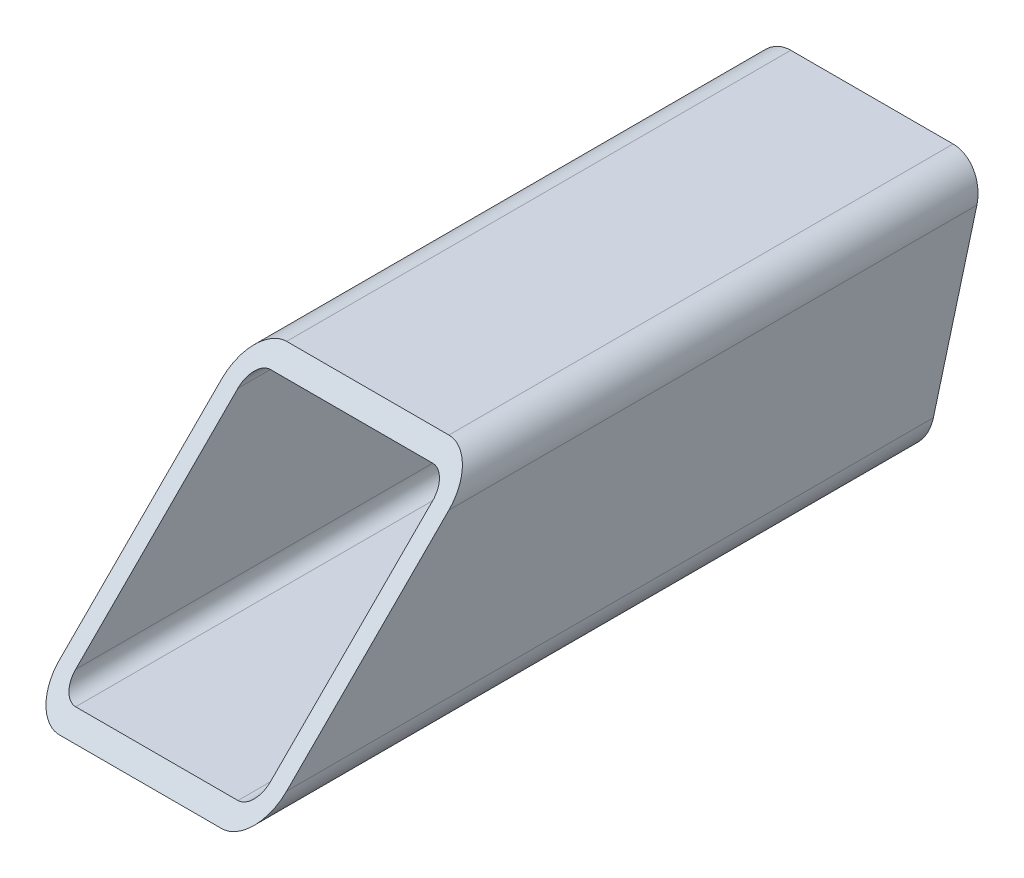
from build123d import *

# Parameters (mm, degrees)
BOSS_EXTRU_1_DEPTH      = 230
ENL_V_MAT_EXTRU_1_DEPTH = 250


with BuildPart() as part:
    # Esquisse1 → Boss.-Extru.1 (new body)
    with BuildSketch(Plane.XY):
        with BuildLine():
            Line((-25, 35), (25, 35))
            ThreePointArc((25, 35), (32.071067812, 32.071067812), (35, 25))
            Line((35, 25), (35, -25))
            ThreePointArc((35, -25), (32.071067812, -32.071067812), (25, -35))
            Line((25, -35), (-25, -35))
            ThreePointArc((-25, -35), (-32.071067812, -32.071067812), (-35, -25))
            Line((-35, -25), (-35, 25))
            ThreePointArc((-35, 25), (-32.071067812, 32.071067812), (-25, 35))
        make_face()
        with BuildLine():
            Line((-25, 30), (25, 30))
            ThreePointArc((25, 30), (28.535533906, 28.535533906), (30, 25))
            Line((30, 25), (30, -25))
            ThreePointArc((30, -25), (28.535533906, -28.535533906), (25, -30))
            Line((25, -30), (-25, -30))
            ThreePointArc((-25, -30), (-28.535533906, -28.535533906), (-30, -25))
            Line((-30, -25), (-30, 25))
            ThreePointArc((-30, 25), (-28.535533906, 28.535533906), (-25, 30))
        make_face(mode=Mode.SUBTRACT)
    extrude(amount=BOSS_EXTRU_1_DEPTH)

    # Esquisse3 → Enl_v. mat.-Extru.1 (cut)
    with BuildSketch(Plane.ZY.offset(35)):
        Polygon((0, 35), (18.75644347, -35), (0, -35), align=None)
        Polygon((225.32144347, -35), (155.32144347, 35), (230, 35), (230, -35), align=None)
    extrude(amount=-ENL_V_MAT_EXTRU_1_DEPTH, mode=Mode.SUBTRACT)


solid = part.part
